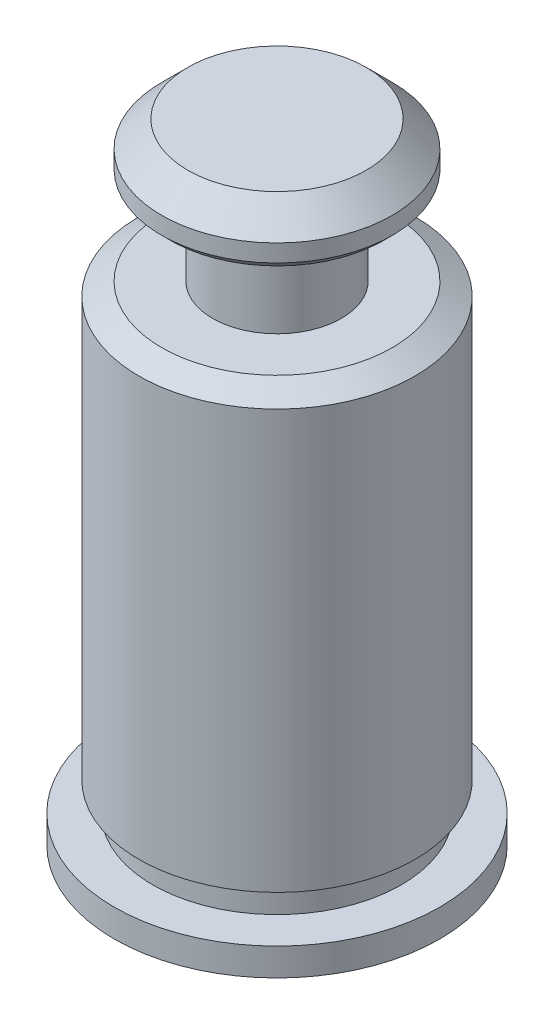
from build123d import *


with BuildPart() as part:
    # BodySke → Body (revolve)
    with BuildSketch(Plane.XY, mode=Mode.PRIVATE) as body_sk:
        Polygon((2.6924, 0), (3.175, 0), (3.175, 0.53848), (2.42316, 0.53848), (2.42316, 1.103884), (2.6924, 1.103884), (2.6924, 9.268367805), (2.2479, 9.525), (1.2573, 9.525), (1.2573, 11.2522), (2.078566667, 11.2522), (2.2479, 11.421533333), (2.2479, 11.7602), (1.7399, 12.2682), (0, 12.2682), (0, 0.00508), (2.6924, 0.00508), align=None)
    revolve(body_sk.sketch.rotate(Axis((0, 0, 0), (0, 1, 0)), 90), axis=Axis((0, 0, 0), (0, 1, 0)))


solid = part.part
